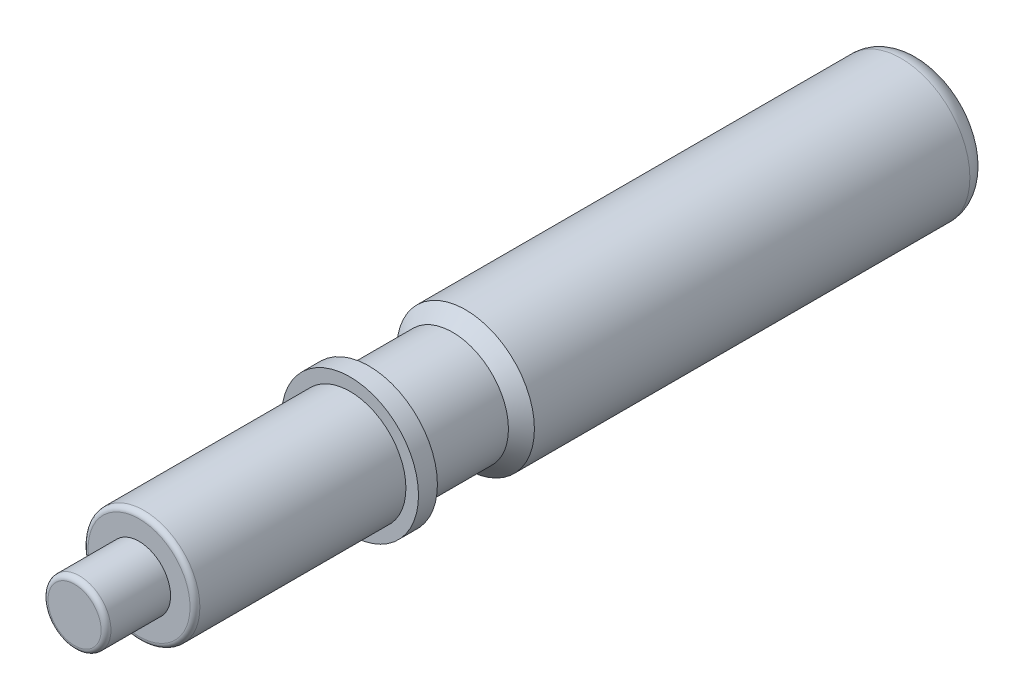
from build123d import *


with BuildPart() as part:
    # Sketch 1 → Revolve 1 (revolve)
    with BuildSketch(Plane(origin=(0, 0, 0), x_dir=(0, 0, -1), z_dir=(1, 0, 0)), mode=Mode.PRIVATE) as revolve_1_sk:
        with BuildLine():
            Line((0, 0), (68.2625, 0))
            Line((68.2625, 0), (68.2625, 3.96875))
            ThreePointArc((68.2625, 3.96875), (67.797532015, 5.091282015), (66.675, 5.55625))
            Line((66.675, 5.55625), (31.543625, 5.55625))
            Line((31.543625, 5.55625), (30.495875, 4.5085))
            Line((30.495875, 4.5085), (23.749, 4.5085))
            Line((23.749, 4.5085), (23.749, 5.5245))
            Line((23.749, 5.5245), (22.225, 5.5245))
            Line((22.225, 5.5245), (22.225, 4.5085))
            Line((22.225, 4.5085), (5.603875, 4.5085))
            ThreePointArc((5.603875, 4.5085), (5.323241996, 4.392258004), (5.207, 4.111625))
            Line((5.207, 4.111625), (5.207, 2.54))
            Line((5.207, 2.54), (0.396875, 2.54))
            ThreePointArc((0.396875, 2.54), (0.116241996, 2.423758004), (0, 2.143125))
            Line((0, 2.143125), (0, 0))
        make_face()
    revolve(revolve_1_sk.sketch.rotate(Axis((0, 0, 0), (0, 0, -1)), 90), axis=Axis((0, 0, 0), (0, 0, -1)))


solid = part.part
